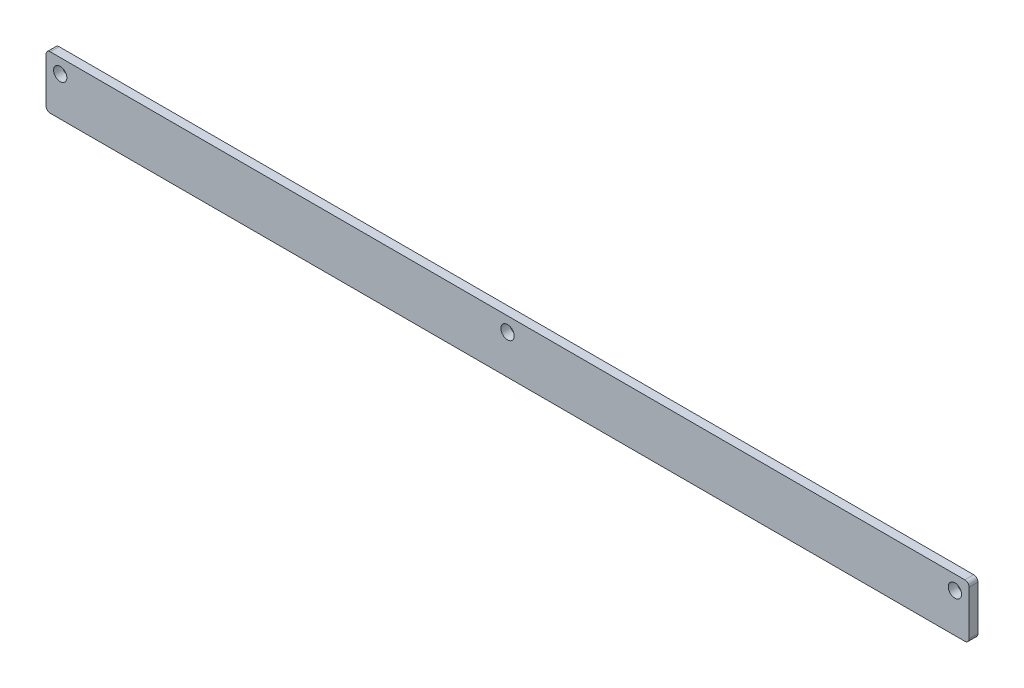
from build123d import *

# Parameters (mm, degrees)
BOSS_EXTRUDE1_DEPTH = 3.175
HOLE1_D             = 4.7625


with BuildPart() as part:
    # Sketch1 → Boss-Extrude1 (new body)
    with BuildSketch(Plane.XY):
        with BuildLine():
            Line((-624.7765, 179.3875), (-951.9285, 179.3875))
            ThreePointArc((-951.9285, 179.3875), (-953.006130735, 179.833869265), (-953.4525, 180.9115))
            Line((-953.4525, 180.9115), (-953.4525, 196.9135))
            ThreePointArc((-953.4525, 196.9135), (-953.006130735, 197.991130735), (-951.9285, 198.4375))
            Line((-951.9285, 198.4375), (-624.7765, 198.4375))
            ThreePointArc((-624.7765, 198.4375), (-623.698869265, 197.991130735), (-623.2525, 196.9135))
            Line((-623.2525, 196.9135), (-623.2525, 180.9115))
            ThreePointArc((-623.2525, 180.9115), (-623.698869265, 179.833869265), (-624.7765, 179.3875))
        make_face()
    extrude(amount=BOSS_EXTRUDE1_DEPTH)

    # Hole1 (through all)
    with Locations(Plane(origin=(-631.986760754, 203.958640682, 3.175), x_dir=(1, 0, 0), z_dir=(0, 0, 1))):
        with Locations((3.654260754, -10.601140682), (-316.385739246, -10.601140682), (-156.365739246, -10.601140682)):
            Hole(HOLE1_D / 2)


solid = part.part
